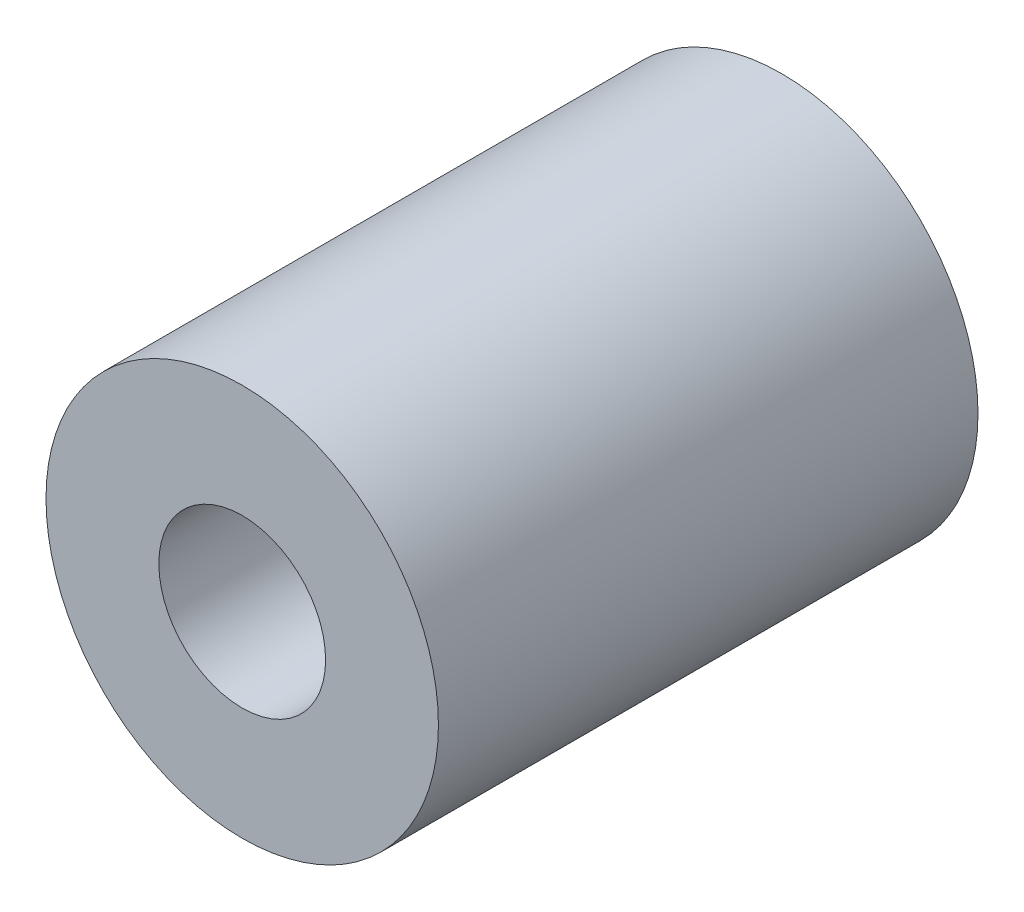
ISO-10303-21;
HEADER;
FILE_DESCRIPTION(('STEP AP214'),'2;1');
FILE_NAME('part.step','',(''),(''),'','','');
FILE_SCHEMA(('AUTOMOTIVE_DESIGN { 1 0 10303 214 1 1 1 1 }'));
ENDSEC;
DATA;
#1=APPLICATION_CONTEXT('core data for automotive mechanical design processes');
#2=APPLICATION_PROTOCOL_DEFINITION('international standard','automotive_design',2000,#1);
#3=PRODUCT_CONTEXT('',#1,'mechanical');
#4=PRODUCT('Part','Part','',(#3));
#5=PRODUCT_RELATED_PRODUCT_CATEGORY('part','',(#4));
#6=PRODUCT_DEFINITION_FORMATION('','',#4);
#7=PRODUCT_DEFINITION_CONTEXT('part definition',#1,'design');
#8=PRODUCT_DEFINITION('design','',#6,#7);
#9=PRODUCT_DEFINITION_SHAPE('','',#8);
#10=(LENGTH_UNIT() NAMED_UNIT(*) SI_UNIT(.MILLI.,.METRE.));
#11=(NAMED_UNIT(*) PLANE_ANGLE_UNIT() SI_UNIT($,.RADIAN.));
#12=(NAMED_UNIT(*) SI_UNIT($,.STERADIAN.) SOLID_ANGLE_UNIT());
#13=UNCERTAINTY_MEASURE_WITH_UNIT(LENGTH_MEASURE(1.E-05),#10,'distance_accuracy_value','');
#14=(GEOMETRIC_REPRESENTATION_CONTEXT(3) GLOBAL_UNCERTAINTY_ASSIGNED_CONTEXT((#13)) GLOBAL_UNIT_ASSIGNED_CONTEXT((#10,
#11,#12)) REPRESENTATION_CONTEXT('',''));
#15=CARTESIAN_POINT('',(0.,0.,0.));
#16=DIRECTION('',(0.,0.,1.));
#17=DIRECTION('',(1.,0.,0.));
#18=AXIS2_PLACEMENT_3D('',#15,#16,#17);
#19=CARTESIAN_POINT('',(0.,0.,13.75));
#20=DIRECTION('',(0.,0.,1.));
#21=DIRECTION('',(1.,0.,0.));
#22=AXIS2_PLACEMENT_3D('',#19,#20,#21);
#23=PLANE('',#22);
#24=CARTESIAN_POINT('',(0.,0.,13.75));
#25=DIRECTION('',(0.,0.,1.));
#26=DIRECTION('',(1.,0.,0.));
#27=AXIS2_PLACEMENT_3D('',#24,#25,#26);
#28=CIRCLE('',#27,10.);
#29=CARTESIAN_POINT('',(10.,0.,13.75));
#30=VERTEX_POINT('',#29);
#31=EDGE_CURVE('E10',#30,#30,#28,.T.);
#32=ORIENTED_EDGE('',*,*,#31,.T.);
#33=EDGE_LOOP('',(#32));
#34=FACE_BOUND('',#33,.T.);
#35=CARTESIAN_POINT('',(0.,0.,13.75));
#36=DIRECTION('',(0.,0.,1.));
#37=DIRECTION('',(1.,0.,0.));
#38=AXIS2_PLACEMENT_3D('',#35,#36,#37);
#39=CIRCLE('',#38,4.25);
#40=CARTESIAN_POINT('',(4.25,0.,13.75));
#41=VERTEX_POINT('',#40);
#42=EDGE_CURVE('E48',#41,#41,#39,.T.);
#43=ORIENTED_EDGE('',*,*,#42,.F.);
#44=EDGE_LOOP('',(#43));
#45=FACE_BOUND('',#44,.T.);
#46=ADVANCED_FACE('F34',(#34,#45),#23,.T.);
#47=CARTESIAN_POINT('',(0.,0.,-13.75));
#48=DIRECTION('',(0.,0.,1.));
#49=DIRECTION('',(1.,0.,0.));
#50=AXIS2_PLACEMENT_3D('',#47,#48,#49);
#51=PLANE('',#50);
#52=CARTESIAN_POINT('',(0.,0.,-13.75));
#53=DIRECTION('',(0.,0.,1.));
#54=DIRECTION('',(1.,0.,0.));
#55=AXIS2_PLACEMENT_3D('',#52,#53,#54);
#56=CIRCLE('',#55,10.);
#57=CARTESIAN_POINT('',(10.,0.,-13.75));
#58=VERTEX_POINT('',#57);
#59=EDGE_CURVE('E38',#58,#58,#56,.T.);
#60=ORIENTED_EDGE('',*,*,#59,.F.);
#61=EDGE_LOOP('',(#60));
#62=FACE_BOUND('',#61,.T.);
#63=CARTESIAN_POINT('',(0.,0.,-13.75));
#64=DIRECTION('',(0.,0.,1.));
#65=DIRECTION('',(1.,0.,0.));
#66=AXIS2_PLACEMENT_3D('',#63,#64,#65);
#67=CIRCLE('',#66,4.25);
#68=CARTESIAN_POINT('',(4.25,0.,-13.75));
#69=VERTEX_POINT('',#68);
#70=EDGE_CURVE('E50',#69,#69,#67,.T.);
#71=ORIENTED_EDGE('',*,*,#70,.T.);
#72=EDGE_LOOP('',(#71));
#73=FACE_BOUND('',#72,.T.);
#74=ADVANCED_FACE('F61',(#62,#73),#51,.F.);
#75=CARTESIAN_POINT('',(0.,0.,13.75));
#76=DIRECTION('',(0.,0.,-1.));
#77=DIRECTION('',(-1.,0.,0.));
#78=AXIS2_PLACEMENT_3D('',#75,#76,#77);
#79=CYLINDRICAL_SURFACE('',#78,10.);
#80=ORIENTED_EDGE('',*,*,#31,.F.);
#81=EDGE_LOOP('',(#80));
#82=FACE_BOUND('',#81,.T.);
#83=ORIENTED_EDGE('',*,*,#59,.T.);
#84=EDGE_LOOP('',(#83));
#85=FACE_BOUND('',#84,.T.);
#86=ADVANCED_FACE('F36',(#82,#85),#79,.T.);
#87=CARTESIAN_POINT('',(0.,0.,13.75));
#88=DIRECTION('',(0.,0.,-1.));
#89=DIRECTION('',(-1.,0.,0.));
#90=AXIS2_PLACEMENT_3D('',#87,#88,#89);
#91=CYLINDRICAL_SURFACE('',#90,4.25);
#92=ORIENTED_EDGE('',*,*,#42,.T.);
#93=EDGE_LOOP('',(#92));
#94=FACE_BOUND('',#93,.T.);
#95=ORIENTED_EDGE('',*,*,#70,.F.);
#96=EDGE_LOOP('',(#95));
#97=FACE_BOUND('',#96,.T.);
#98=ADVANCED_FACE('F57',(#94,#97),#91,.F.);
#99=CLOSED_SHELL('',(#46,#74,#86,#98));
#100=MANIFOLD_SOLID_BREP('B2',#99);
#101=ADVANCED_BREP_SHAPE_REPRESENTATION('',(#18,#100),#14);
#102=SHAPE_DEFINITION_REPRESENTATION(#9,#101);
ENDSEC;
END-ISO-10303-21;
